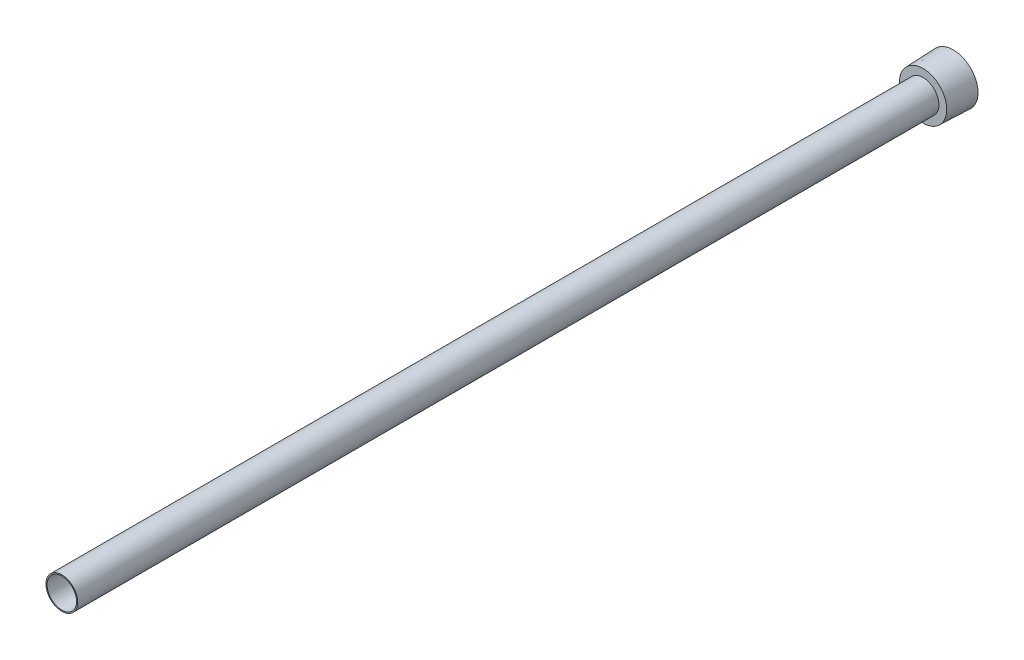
ISO-10303-21;
HEADER;
FILE_DESCRIPTION(('STEP AP214'),'2;1');
FILE_NAME('part.step','',(''),(''),'','','');
FILE_SCHEMA(('AUTOMOTIVE_DESIGN { 1 0 10303 214 1 1 1 1 }'));
ENDSEC;
DATA;
#1=APPLICATION_CONTEXT('core data for automotive mechanical design processes');
#2=APPLICATION_PROTOCOL_DEFINITION('international standard','automotive_design',2000,#1);
#3=PRODUCT_CONTEXT('',#1,'mechanical');
#4=PRODUCT('Part','Part','',(#3));
#5=PRODUCT_RELATED_PRODUCT_CATEGORY('part','',(#4));
#6=PRODUCT_DEFINITION_FORMATION('','',#4);
#7=PRODUCT_DEFINITION_CONTEXT('part definition',#1,'design');
#8=PRODUCT_DEFINITION('design','',#6,#7);
#9=PRODUCT_DEFINITION_SHAPE('','',#8);
#10=(LENGTH_UNIT() NAMED_UNIT(*) SI_UNIT(.MILLI.,.METRE.));
#11=(NAMED_UNIT(*) PLANE_ANGLE_UNIT() SI_UNIT($,.RADIAN.));
#12=(NAMED_UNIT(*) SI_UNIT($,.STERADIAN.) SOLID_ANGLE_UNIT());
#13=UNCERTAINTY_MEASURE_WITH_UNIT(LENGTH_MEASURE(1.E-05),#10,'distance_accuracy_value','');
#14=(GEOMETRIC_REPRESENTATION_CONTEXT(3) GLOBAL_UNCERTAINTY_ASSIGNED_CONTEXT((#13)) GLOBAL_UNIT_ASSIGNED_CONTEXT((#10,
#11,#12)) REPRESENTATION_CONTEXT('',''));
#15=CARTESIAN_POINT('',(0.,0.,0.));
#16=DIRECTION('',(0.,0.,1.));
#17=DIRECTION('',(1.,0.,0.));
#18=AXIS2_PLACEMENT_3D('',#15,#16,#17);
#19=CARTESIAN_POINT('',(0.,0.,0.));
#20=DIRECTION('',(0.,0.,1.));
#21=DIRECTION('',(1.,0.,0.));
#22=AXIS2_PLACEMENT_3D('',#19,#20,#21);
#23=CYLINDRICAL_SURFACE('',#22,5.0419);
#24=CARTESIAN_POINT('',(0.,0.,304.8));
#25=DIRECTION('',(0.,0.,1.));
#26=DIRECTION('',(1.,0.,0.));
#27=AXIS2_PLACEMENT_3D('',#24,#25,#26);
#28=CIRCLE('',#27,5.0419);
#29=CARTESIAN_POINT('',(5.0419,0.,304.8));
#30=VERTEX_POINT('',#29);
#31=EDGE_CURVE('E141',#30,#30,#28,.T.);
#32=CARTESIAN_POINT('',(0.,0.,6.35));
#33=DIRECTION('',(0.,0.,-1.));
#34=DIRECTION('',(-1.,0.,0.));
#35=AXIS2_PLACEMENT_3D('',#32,#33,#34);
#36=CIRCLE('',#35,5.0419);
#37=CARTESIAN_POINT('',(5.0419,0.,6.35));
#38=VERTEX_POINT('',#37);
#39=EDGE_CURVE('E36',#38,#38,#36,.F.);
#40=CARTESIAN_POINT('',(5.0419,0.,304.8));
#41=CARTESIAN_POINT('',(5.0419,0.,301.691145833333));
#42=CARTESIAN_POINT('',(5.0419,0.,298.582291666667));
#43=CARTESIAN_POINT('',(5.0419,0.,292.364583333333));
#44=CARTESIAN_POINT('',(5.0419,0.,289.255729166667));
#45=CARTESIAN_POINT('',(5.0419,0.,283.038020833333));
#46=CARTESIAN_POINT('',(5.0419,0.,279.929166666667));
#47=CARTESIAN_POINT('',(5.0419,0.,273.711458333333));
#48=CARTESIAN_POINT('',(5.0419,0.,270.602604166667));
#49=CARTESIAN_POINT('',(5.0419,0.,264.384895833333));
#50=CARTESIAN_POINT('',(5.0419,0.,261.276041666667));
#51=CARTESIAN_POINT('',(5.0419,0.,255.058333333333));
#52=CARTESIAN_POINT('',(5.0419,0.,251.949479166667));
#53=CARTESIAN_POINT('',(5.0419,0.,245.731770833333));
#54=CARTESIAN_POINT('',(5.0419,0.,242.622916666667));
#55=CARTESIAN_POINT('',(5.0419,0.,236.405208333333));
#56=CARTESIAN_POINT('',(5.0419,0.,233.296354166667));
#57=CARTESIAN_POINT('',(5.0419,0.,227.078645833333));
#58=CARTESIAN_POINT('',(5.0419,0.,223.969791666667));
#59=CARTESIAN_POINT('',(5.0419,0.,217.752083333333));
#60=CARTESIAN_POINT('',(5.0419,0.,214.643229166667));
#61=CARTESIAN_POINT('',(5.0419,0.,208.425520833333));
#62=CARTESIAN_POINT('',(5.0419,0.,205.316666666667));
#63=CARTESIAN_POINT('',(5.0419,0.,199.098958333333));
#64=CARTESIAN_POINT('',(5.0419,0.,195.990104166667));
#65=CARTESIAN_POINT('',(5.0419,0.,189.772395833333));
#66=CARTESIAN_POINT('',(5.0419,0.,186.663541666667));
#67=CARTESIAN_POINT('',(5.0419,0.,180.445833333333));
#68=CARTESIAN_POINT('',(5.0419,0.,177.336979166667));
#69=CARTESIAN_POINT('',(5.0419,0.,171.119270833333));
#70=CARTESIAN_POINT('',(5.0419,0.,168.010416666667));
#71=CARTESIAN_POINT('',(5.0419,0.,161.792708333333));
#72=CARTESIAN_POINT('',(5.0419,0.,158.683854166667));
#73=CARTESIAN_POINT('',(5.0419,0.,152.466145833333));
#74=CARTESIAN_POINT('',(5.0419,0.,149.357291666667));
#75=CARTESIAN_POINT('',(5.0419,0.,143.139583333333));
#76=CARTESIAN_POINT('',(5.0419,0.,140.030729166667));
#77=CARTESIAN_POINT('',(5.0419,0.,133.813020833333));
#78=CARTESIAN_POINT('',(5.0419,0.,130.704166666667));
#79=CARTESIAN_POINT('',(5.0419,0.,124.486458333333));
#80=CARTESIAN_POINT('',(5.0419,0.,121.377604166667));
#81=CARTESIAN_POINT('',(5.0419,0.,115.159895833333));
#82=CARTESIAN_POINT('',(5.0419,0.,112.051041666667));
#83=CARTESIAN_POINT('',(5.0419,0.,105.833333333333));
#84=CARTESIAN_POINT('',(5.0419,0.,102.724479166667));
#85=CARTESIAN_POINT('',(5.0419,0.,96.5067708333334));
#86=CARTESIAN_POINT('',(5.0419,0.,93.3979166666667));
#87=CARTESIAN_POINT('',(5.0419,0.,87.1802083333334));
#88=CARTESIAN_POINT('',(5.0419,0.,84.0713541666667));
#89=CARTESIAN_POINT('',(5.0419,0.,77.8536458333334));
#90=CARTESIAN_POINT('',(5.0419,0.,74.7447916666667));
#91=CARTESIAN_POINT('',(5.0419,0.,68.5270833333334));
#92=CARTESIAN_POINT('',(5.0419,0.,65.4182291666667));
#93=CARTESIAN_POINT('',(5.0419,0.,59.2005208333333));
#94=CARTESIAN_POINT('',(5.0419,0.,56.0916666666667));
#95=CARTESIAN_POINT('',(5.0419,0.,49.8739583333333));
#96=CARTESIAN_POINT('',(5.0419,0.,46.7651041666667));
#97=CARTESIAN_POINT('',(5.0419,0.,40.5473958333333));
#98=CARTESIAN_POINT('',(5.0419,0.,37.4385416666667));
#99=CARTESIAN_POINT('',(5.0419,0.,31.2208333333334));
#100=CARTESIAN_POINT('',(5.0419,0.,28.1119791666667));
#101=CARTESIAN_POINT('',(5.0419,0.,21.8942708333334));
#102=CARTESIAN_POINT('',(5.0419,0.,18.7854166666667));
#103=CARTESIAN_POINT('',(5.0419,0.,12.5677083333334));
#104=CARTESIAN_POINT('',(5.0419,0.,9.45885416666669));
#105=CARTESIAN_POINT('',(5.0419,0.,6.35000000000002));
#106=B_SPLINE_CURVE_WITH_KNOTS('',3,(#40,#41,#42,#43,#44,#45,#46,#47,#48,#49,#50,#51,#52,#53,
#54,#55,#56,#57,#58,#59,#60,#61,#62,#63,#64,#65,#66,#67,#68,#69,#70,#71,#72,#73,#74,#75,#76,#77,
#78,#79,#80,#81,#82,#83,#84,#85,#86,#87,#88,#89,#90,#91,#92,#93,#94,#95,#96,#97,#98,#99,#100,
#101,#102,#103,#104,#105),.UNSPECIFIED.,.F.,.F.,(4,2,2,2,2,2,2,2,2,2,2,2,2,2,2,2,2,2,2,2,2,2,2,
2,2,2,2,2,2,2,2,2,4),(0.,9.32656250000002,18.653125,27.9796875,37.30625,46.6328125,55.959375,
65.2859375,74.6125,83.9390625,93.265625,102.5921875,111.91875,121.2453125,130.571875,
139.8984375,149.225,158.5515625,167.878125,177.2046875,186.53125,195.8578125,205.184375,
214.5109375,223.8375,233.1640625,242.490625,251.8171875,261.14375,270.4703125,279.796875,
289.1234375,298.45),.UNSPECIFIED.);
#107=EDGE_CURVE('BSEAM32',#30,#38,#106,.T.);
#108=ORIENTED_EDGE('',*,*,#31,.T.);
#109=ORIENTED_EDGE('',*,*,#39,.F.);
#110=ORIENTED_EDGE('',*,*,#107,.T.);
#111=ORIENTED_EDGE('',*,*,#107,.F.);
#112=EDGE_LOOP('',(#108,#110,#109,#111));
#113=FACE_BOUND('',#112,.T.);
#114=ADVANCED_FACE('F32',(#113),#23,.F.);
#115=CARTESIAN_POINT('',(0.,0.,0.));
#116=DIRECTION('',(0.,0.,-1.));
#117=DIRECTION('',(-1.,0.,0.));
#118=AXIS2_PLACEMENT_3D('',#115,#116,#117);
#119=CONICAL_SURFACE('',#118,8.4709,0.0364599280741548);
#120=CARTESIAN_POINT('',(0.,0.,10.3124));
#121=DIRECTION('',(0.,0.,1.));
#122=DIRECTION('',(1.,0.,0.));
#123=AXIS2_PLACEMENT_3D('',#120,#121,#122);
#124=CIRCLE('',#123,8.09474394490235);
#125=CARTESIAN_POINT('',(8.09474394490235,0.,10.3124));
#126=VERTEX_POINT('',#125);
#127=EDGE_CURVE('E11',#126,#126,#124,.T.);
#128=ORIENTED_EDGE('',*,*,#127,.F.);
#129=EDGE_LOOP('',(#128));
#130=FACE_BOUND('',#129,.T.);
#131=CARTESIAN_POINT('',(0.,0.,0.));
#132=DIRECTION('',(0.,0.,1.));
#133=DIRECTION('',(1.,0.,0.));
#134=AXIS2_PLACEMENT_3D('',#131,#132,#133);
#135=CIRCLE('',#134,8.4709);
#136=CARTESIAN_POINT('',(8.4709,0.,0.));
#137=VERTEX_POINT('',#136);
#138=EDGE_CURVE('E144',#137,#137,#135,.T.);
#139=ORIENTED_EDGE('',*,*,#138,.T.);
#140=EDGE_LOOP('',(#139));
#141=FACE_BOUND('',#140,.T.);
#142=ADVANCED_FACE('F34',(#130,#141),#119,.T.);
#143=CARTESIAN_POINT('',(0.,8.09474394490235,10.3124));
#144=DIRECTION('',(0.,0.,-1.));
#145=DIRECTION('',(-1.,0.,0.));
#146=AXIS2_PLACEMENT_3D('',#143,#144,#145);
#147=PLANE('',#146);
#148=CARTESIAN_POINT('',(0.,0.,10.3124));
#149=DIRECTION('',(0.,0.,1.));
#150=DIRECTION('',(1.,0.,0.));
#151=AXIS2_PLACEMENT_3D('',#148,#149,#150);
#152=CIRCLE('',#151,5.4229);
#153=CARTESIAN_POINT('',(5.4229,0.,10.3124));
#154=VERTEX_POINT('',#153);
#155=EDGE_CURVE('E41',#154,#154,#152,.T.);
#156=ORIENTED_EDGE('',*,*,#155,.F.);
#157=EDGE_LOOP('',(#156));
#158=FACE_BOUND('',#157,.T.);
#159=ORIENTED_EDGE('',*,*,#127,.T.);
#160=EDGE_LOOP('',(#159));
#161=FACE_BOUND('',#160,.T.);
#162=ADVANCED_FACE('F155',(#158,#161),#147,.F.);
#163=CARTESIAN_POINT('',(0.,0.,168.793426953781));
#164=DIRECTION('',(0.,0.,1.));
#165=DIRECTION('',(1.,0.,0.));
#166=AXIS2_PLACEMENT_3D('',#163,#164,#165);
#167=CYLINDRICAL_SURFACE('',#166,5.42289999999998);
#168=CARTESIAN_POINT('',(0.,0.,304.8));
#169=DIRECTION('',(0.,0.,1.));
#170=DIRECTION('',(1.,0.,0.));
#171=AXIS2_PLACEMENT_3D('',#168,#169,#170);
#172=CIRCLE('',#171,5.42289999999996);
#173=CARTESIAN_POINT('',(5.42289999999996,0.,304.8));
#174=VERTEX_POINT('',#173);
#175=EDGE_CURVE('E147',#174,#174,#172,.T.);
#176=ORIENTED_EDGE('',*,*,#175,.F.);
#177=EDGE_LOOP('',(#176));
#178=FACE_BOUND('',#177,.T.);
#179=ORIENTED_EDGE('',*,*,#155,.T.);
#180=EDGE_LOOP('',(#179));
#181=FACE_BOUND('',#180,.T.);
#182=ADVANCED_FACE('F153',(#178,#181),#167,.T.);
#183=CARTESIAN_POINT('',(0.,5.42289999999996,304.8));
#184=DIRECTION('',(0.,0.,-1.));
#185=DIRECTION('',(-1.,0.,0.));
#186=AXIS2_PLACEMENT_3D('',#183,#184,#185);
#187=PLANE('',#186);
#188=ORIENTED_EDGE('',*,*,#31,.F.);
#189=EDGE_LOOP('',(#188));
#190=FACE_BOUND('',#189,.T.);
#191=ORIENTED_EDGE('',*,*,#175,.T.);
#192=EDGE_LOOP('',(#191));
#193=FACE_BOUND('',#192,.T.);
#194=ADVANCED_FACE('F166',(#190,#193),#187,.F.);
#195=CARTESIAN_POINT('',(0.,0.,0.));
#196=DIRECTION('',(0.,0.,1.));
#197=DIRECTION('',(1.,0.,0.));
#198=AXIS2_PLACEMENT_3D('',#195,#196,#197);
#199=PLANE('',#198);
#200=DIRECTION('',(-0.866025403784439,0.5,0.));
#201=VECTOR('',#200,1.);
#202=CARTESIAN_POINT('',(0.,-6.41580486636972,0.));
#203=LINE('',#202,#201);
#204=CARTESIAN_POINT('',(0.,-6.41580486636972,0.));
#205=VERTEX_POINT('',#204);
#206=CARTESIAN_POINT('',(-5.55625,-3.20790243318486,0.));
#207=VERTEX_POINT('',#206);
#208=EDGE_CURVE('E123',#205,#207,#203,.T.);
#209=ORIENTED_EDGE('',*,*,#208,.F.);
#210=DIRECTION('',(-0.866025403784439,-0.5,0.));
#211=VECTOR('',#210,1.);
#212=CARTESIAN_POINT('',(5.55625,-3.20790243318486,0.));
#213=LINE('',#212,#211);
#214=CARTESIAN_POINT('',(5.55625,-3.20790243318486,0.));
#215=VERTEX_POINT('',#214);
#216=EDGE_CURVE('E48',#215,#205,#213,.T.);
#217=ORIENTED_EDGE('',*,*,#216,.F.);
#218=DIRECTION('',(0.,-1.,0.));
#219=VECTOR('',#218,1.);
#220=CARTESIAN_POINT('',(5.55625,3.20790243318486,0.));
#221=LINE('',#220,#219);
#222=CARTESIAN_POINT('',(5.55625,3.20790243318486,0.));
#223=VERTEX_POINT('',#222);
#224=EDGE_CURVE('E132',#223,#215,#221,.T.);
#225=ORIENTED_EDGE('',*,*,#224,.F.);
#226=DIRECTION('',(0.866025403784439,-0.5,0.));
#227=VECTOR('',#226,1.);
#228=CARTESIAN_POINT('',(0.,6.41580486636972,0.));
#229=LINE('',#228,#227);
#230=CARTESIAN_POINT('',(0.,6.41580486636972,0.));
#231=VERTEX_POINT('',#230);
#232=EDGE_CURVE('E130',#231,#223,#229,.T.);
#233=ORIENTED_EDGE('',*,*,#232,.F.);
#234=DIRECTION('',(0.866025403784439,0.5,0.));
#235=VECTOR('',#234,1.);
#236=CARTESIAN_POINT('',(-5.55625,3.20790243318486,0.));
#237=LINE('',#236,#235);
#238=CARTESIAN_POINT('',(-5.55625,3.20790243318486,0.));
#239=VERTEX_POINT('',#238);
#240=EDGE_CURVE('E96',#239,#231,#237,.T.);
#241=ORIENTED_EDGE('',*,*,#240,.F.);
#242=DIRECTION('',(0.,1.,0.));
#243=VECTOR('',#242,1.);
#244=CARTESIAN_POINT('',(-5.55625,-3.20790243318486,0.));
#245=LINE('',#244,#243);
#246=EDGE_CURVE('E126',#207,#239,#245,.T.);
#247=ORIENTED_EDGE('',*,*,#246,.F.);
#248=EDGE_LOOP('',(#209,#217,#225,#233,#241,#247));
#249=FACE_BOUND('',#248,.T.);
#250=ORIENTED_EDGE('',*,*,#138,.F.);
#251=EDGE_LOOP('',(#250));
#252=FACE_BOUND('',#251,.T.);
#253=ADVANCED_FACE('F164',(#249,#252),#199,.F.);
#254=CARTESIAN_POINT('',(0.,-6.41580486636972,6.35));
#255=DIRECTION('',(0.,0.,-1.));
#256=DIRECTION('',(-1.,0.,0.));
#257=AXIS2_PLACEMENT_3D('',#254,#255,#256);
#258=PLANE('',#257);
#259=DIRECTION('',(-0.866025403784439,-0.5,0.));
#260=VECTOR('',#259,1.);
#261=CARTESIAN_POINT('',(5.55625,-3.20790243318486,6.35));
#262=LINE('',#261,#260);
#263=CARTESIAN_POINT('',(5.55625,-3.20790243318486,6.35));
#264=VERTEX_POINT('',#263);
#265=CARTESIAN_POINT('',(0.,-6.41580486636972,6.35));
#266=VERTEX_POINT('',#265);
#267=EDGE_CURVE('E134',#264,#266,#262,.T.);
#268=ORIENTED_EDGE('',*,*,#267,.T.);
#269=DIRECTION('',(-0.866025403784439,0.5,0.));
#270=VECTOR('',#269,1.);
#271=CARTESIAN_POINT('',(0.,-6.41580486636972,6.35));
#272=LINE('',#271,#270);
#273=CARTESIAN_POINT('',(-5.55625,-3.20790243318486,6.35));
#274=VERTEX_POINT('',#273);
#275=EDGE_CURVE('E117',#266,#274,#272,.T.);
#276=ORIENTED_EDGE('',*,*,#275,.T.);
#277=DIRECTION('',(0.,1.,0.));
#278=VECTOR('',#277,1.);
#279=CARTESIAN_POINT('',(-5.55625,-3.20790243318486,6.35));
#280=LINE('',#279,#278);
#281=CARTESIAN_POINT('',(-5.55625,3.20790243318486,6.35));
#282=VERTEX_POINT('',#281);
#283=EDGE_CURVE('E115',#274,#282,#280,.T.);
#284=ORIENTED_EDGE('',*,*,#283,.T.);
#285=DIRECTION('',(0.866025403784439,0.5,0.));
#286=VECTOR('',#285,1.);
#287=CARTESIAN_POINT('',(-5.55625,3.20790243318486,6.35));
#288=LINE('',#287,#286);
#289=CARTESIAN_POINT('',(0.,6.41580486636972,6.35));
#290=VERTEX_POINT('',#289);
#291=EDGE_CURVE('E93',#282,#290,#288,.T.);
#292=ORIENTED_EDGE('',*,*,#291,.T.);
#293=DIRECTION('',(0.866025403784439,-0.5,0.));
#294=VECTOR('',#293,1.);
#295=CARTESIAN_POINT('',(0.,6.41580486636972,6.35));
#296=LINE('',#295,#294);
#297=CARTESIAN_POINT('',(5.55625,3.20790243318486,6.35));
#298=VERTEX_POINT('',#297);
#299=EDGE_CURVE('E104',#290,#298,#296,.T.);
#300=ORIENTED_EDGE('',*,*,#299,.T.);
#301=DIRECTION('',(0.,-1.,0.));
#302=VECTOR('',#301,1.);
#303=CARTESIAN_POINT('',(5.55625,3.20790243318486,6.35));
#304=LINE('',#303,#302);
#305=EDGE_CURVE('E108',#298,#264,#304,.T.);
#306=ORIENTED_EDGE('',*,*,#305,.T.);
#307=EDGE_LOOP('',(#268,#276,#284,#292,#300,#306));
#308=FACE_BOUND('',#307,.T.);
#309=ORIENTED_EDGE('',*,*,#39,.T.);
#310=EDGE_LOOP('',(#309));
#311=FACE_BOUND('',#310,.T.);
#312=ADVANCED_FACE('F111',(#308,#311),#258,.T.);
#313=CARTESIAN_POINT('',(5.55625,-3.20790243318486,6.35));
#314=DIRECTION('',(0.5,-0.866025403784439,0.));
#315=DIRECTION('',(0.866025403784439,0.5,0.));
#316=AXIS2_PLACEMENT_3D('',#313,#314,#315);
#317=PLANE('',#316);
#318=ORIENTED_EDGE('',*,*,#216,.T.);
#319=DIRECTION('',(0.,0.,-1.));
#320=VECTOR('',#319,1.);
#321=CARTESIAN_POINT('',(0.,-6.41580486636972,6.35));
#322=LINE('',#321,#320);
#323=EDGE_CURVE('E78',#266,#205,#322,.T.);
#324=ORIENTED_EDGE('',*,*,#323,.F.);
#325=ORIENTED_EDGE('',*,*,#267,.F.);
#326=DIRECTION('',(0.,0.,-1.));
#327=VECTOR('',#326,1.);
#328=CARTESIAN_POINT('',(5.55625,-3.20790243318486,6.35));
#329=LINE('',#328,#327);
#330=EDGE_CURVE('E56',#264,#215,#329,.T.);
#331=ORIENTED_EDGE('',*,*,#330,.T.);
#332=EDGE_LOOP('',(#318,#324,#325,#331));
#333=FACE_BOUND('',#332,.T.);
#334=ADVANCED_FACE('F173',(#333),#317,.F.);
#335=CARTESIAN_POINT('',(5.55625,3.20790243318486,6.35));
#336=DIRECTION('',(1.,0.,0.));
#337=DIRECTION('',(0.,0.,-1.));
#338=AXIS2_PLACEMENT_3D('',#335,#336,#337);
#339=PLANE('',#338);
#340=ORIENTED_EDGE('',*,*,#224,.T.);
#341=ORIENTED_EDGE('',*,*,#330,.F.);
#342=ORIENTED_EDGE('',*,*,#305,.F.);
#343=DIRECTION('',(0.,0.,-1.));
#344=VECTOR('',#343,1.);
#345=CARTESIAN_POINT('',(5.55625,3.20790243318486,6.35));
#346=LINE('',#345,#344);
#347=EDGE_CURVE('E100',#298,#223,#346,.T.);
#348=ORIENTED_EDGE('',*,*,#347,.T.);
#349=EDGE_LOOP('',(#340,#341,#342,#348));
#350=FACE_BOUND('',#349,.T.);
#351=ADVANCED_FACE('F187',(#350),#339,.F.);
#352=CARTESIAN_POINT('',(0.,6.41580486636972,6.35));
#353=DIRECTION('',(0.5,0.866025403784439,0.));
#354=DIRECTION('',(-0.866025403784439,0.5,0.));
#355=AXIS2_PLACEMENT_3D('',#352,#353,#354);
#356=PLANE('',#355);
#357=ORIENTED_EDGE('',*,*,#232,.T.);
#358=ORIENTED_EDGE('',*,*,#347,.F.);
#359=ORIENTED_EDGE('',*,*,#299,.F.);
#360=DIRECTION('',(0.,0.,-1.));
#361=VECTOR('',#360,1.);
#362=CARTESIAN_POINT('',(0.,6.41580486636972,6.35));
#363=LINE('',#362,#361);
#364=EDGE_CURVE('E89',#290,#231,#363,.T.);
#365=ORIENTED_EDGE('',*,*,#364,.T.);
#366=EDGE_LOOP('',(#357,#358,#359,#365));
#367=FACE_BOUND('',#366,.T.);
#368=ADVANCED_FACE('F105',(#367),#356,.F.);
#369=CARTESIAN_POINT('',(-5.55625,3.20790243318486,6.35));
#370=DIRECTION('',(-0.5,0.866025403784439,0.));
#371=DIRECTION('',(-0.866025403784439,-0.5,0.));
#372=AXIS2_PLACEMENT_3D('',#369,#370,#371);
#373=PLANE('',#372);
#374=ORIENTED_EDGE('',*,*,#240,.T.);
#375=ORIENTED_EDGE('',*,*,#364,.F.);
#376=ORIENTED_EDGE('',*,*,#291,.F.);
#377=DIRECTION('',(0.,0.,-1.));
#378=VECTOR('',#377,1.);
#379=CARTESIAN_POINT('',(-5.55625,3.20790243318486,6.35));
#380=LINE('',#379,#378);
#381=EDGE_CURVE('E101',#282,#239,#380,.T.);
#382=ORIENTED_EDGE('',*,*,#381,.T.);
#383=EDGE_LOOP('',(#374,#375,#376,#382));
#384=FACE_BOUND('',#383,.T.);
#385=ADVANCED_FACE('F91',(#384),#373,.F.);
#386=CARTESIAN_POINT('',(-5.55625,-3.20790243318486,6.35));
#387=DIRECTION('',(-1.,0.,0.));
#388=DIRECTION('',(0.,0.,1.));
#389=AXIS2_PLACEMENT_3D('',#386,#387,#388);
#390=PLANE('',#389);
#391=ORIENTED_EDGE('',*,*,#246,.T.);
#392=ORIENTED_EDGE('',*,*,#381,.F.);
#393=ORIENTED_EDGE('',*,*,#283,.F.);
#394=DIRECTION('',(0.,0.,-1.));
#395=VECTOR('',#394,1.);
#396=CARTESIAN_POINT('',(-5.55625,-3.20790243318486,6.35));
#397=LINE('',#396,#395);
#398=EDGE_CURVE('E138',#274,#207,#397,.T.);
#399=ORIENTED_EDGE('',*,*,#398,.T.);
#400=EDGE_LOOP('',(#391,#392,#393,#399));
#401=FACE_BOUND('',#400,.T.);
#402=ADVANCED_FACE('F191',(#401),#390,.F.);
#403=CARTESIAN_POINT('',(0.,-6.41580486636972,6.35));
#404=DIRECTION('',(-0.5,-0.866025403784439,0.));
#405=DIRECTION('',(0.866025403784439,-0.5,0.));
#406=AXIS2_PLACEMENT_3D('',#403,#404,#405);
#407=PLANE('',#406);
#408=ORIENTED_EDGE('',*,*,#208,.T.);
#409=ORIENTED_EDGE('',*,*,#398,.F.);
#410=ORIENTED_EDGE('',*,*,#275,.F.);
#411=ORIENTED_EDGE('',*,*,#323,.T.);
#412=EDGE_LOOP('',(#408,#409,#410,#411));
#413=FACE_BOUND('',#412,.T.);
#414=ADVANCED_FACE('F188',(#413),#407,.F.);
#415=CLOSED_SHELL('',(#114,#142,#162,#182,#194,#253,#312,#334,#351,#368,#385,#402,#414));
#416=MANIFOLD_SOLID_BREP('B2',#415);
#417=ADVANCED_BREP_SHAPE_REPRESENTATION('',(#18,#416),#14);
#418=SHAPE_DEFINITION_REPRESENTATION(#9,#417);
ENDSEC;
END-ISO-10303-21;
